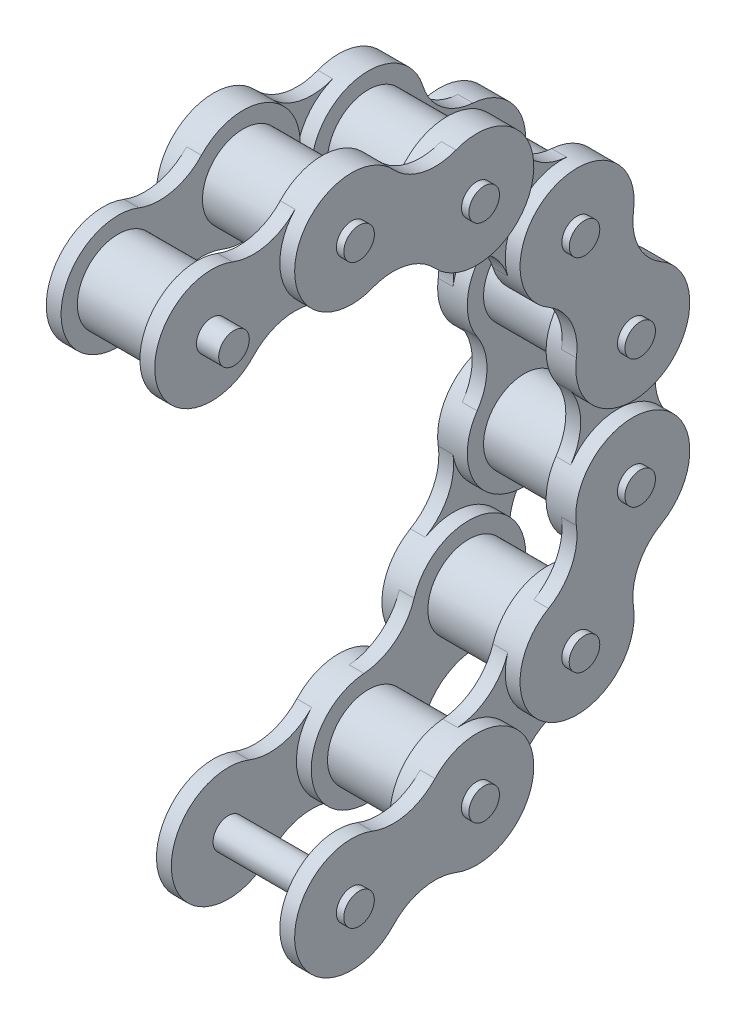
from build123d import *

# Parameters (mm, degrees)
BOSS_EXTRU_1_DEPTH      = 2.202
BOSS_EXTRU_1_2_DEPTH    = 2.202
BOSS_EXTRU_1_3_DEPTH    = 2.202
BOSS_EXTRU_1_4_DEPTH    = 2.202
ESQUISSE3_R             = 6.05
BOSS_EXTRU_2_DEPTH      = 11.7
BOSS_EXTRU_5_DEPTH      = 2.202
BOSS_EXTRU_6_DEPTH      = 3.303
BOSS_EXTRU_6_DEPTH_BACK = 19.407
ESQUISSE10_R            = 2.269
BOSS_EXTRU_7_DEPTH      = 2.202
BOSS_EXTRU_8_START      = 2.202
BOSS_EXTRU_8_DEPTH      = 2.202
BOSS_EXTRU_9_DEPTH      = 1.1
BOSS_EXTRU_9_DEPTH_BACK = 21.609
ESQUISSE13_R            = 2.269


with BuildPart() as part:
    # Esquisse2 → Boss.-Extru.1 (new body)
    with BuildSketch(Plane(origin=(5.55, 0, 0), x_dir=(0, 0, -1), z_dir=(1, 0, 0))):
        with BuildLine():
            ThreePointArc((26.661688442, 41.069207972), (11.953702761, 43.84472778), (17.931784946, 30.122815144))
            ThreePointArc((17.931784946, 30.122815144), (22.569484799, 28.299791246), (25.378581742, 24.183889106))
            ThreePointArc((25.378581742, 24.183889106), (40.086567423, 21.408369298), (34.108485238, 35.130281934))
            ThreePointArc((34.108485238, 35.130281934), (29.470785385, 36.953305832), (26.661688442, 41.069207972))
        make_face()
    extrude(amount=BOSS_EXTRU_1_DEPTH)



with BuildPart() as body_2:
    # Esquisse2 → Boss.-Extru.1 2 (new body)
    with BuildSketch(Plane(origin=(5.55, 0, 0), x_dir=(0, 0, -1), z_dir=(1, 0, 0))):
        with BuildLine():
            ThreePointArc((48.732609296, 4.760069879), (41.732648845, 17.989918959), (34.731368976, 4.760768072))
            ThreePointArc((34.731368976, 4.760768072), (36.197511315, -0.001805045), (34.730893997, -4.764231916))
            ThreePointArc((34.730893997, -4.764231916), (41.730854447, -17.994080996), (48.732134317, -4.764930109))
            ThreePointArc((48.732134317, -4.764930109), (47.265991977, -0.002356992), (48.732609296, 4.760069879))
        make_face()
    extrude(amount=BOSS_EXTRU_1_2_DEPTH)


with BuildPart() as body_3:
    # Esquisse2 → Boss.-Extru.1 3 (new body)
    with BuildSketch(Plane(origin=(5.55, 0, 0), x_dir=(0, 0, -1), z_dir=(1, 0, 0))):
        with BuildLine():
            ThreePointArc((34.104981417, -35.133683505), (40.084432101, -21.41236715), (25.376169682, -24.186420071))
            ThreePointArc((25.376169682, -24.186420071), (22.566662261, -28.30204203), (17.928780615, -30.124603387))
            ThreePointArc((17.928780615, -30.124603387), (11.949329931, -43.845919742), (26.65759235, -41.071866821))
            ThreePointArc((26.65759235, -41.071866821), (29.467099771, -36.956244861), (34.104981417, -35.133683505))
        make_face()
    extrude(amount=BOSS_EXTRU_1_3_DEPTH)


with BuildPart() as body_4:
    # Esquisse2 → Boss.-Extru.1 4 (new body)
    with BuildSketch(Plane(origin=(5.55, 0, 0), x_dir=(0, 0, -1), z_dir=(1, 0, 0))):
        with BuildLine():
            ThreePointArc((-3.085309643, 34.920105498), (8.254714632, 44.689046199), (-6.20087872, 48.570305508))
            ThreePointArc((-6.20087872, 48.570305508), (-10.517672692, 46.080934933), (-15.487067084, 46.450793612))
            ThreePointArc((-15.487067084, 46.450793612), (-26.82709136, 36.681852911), (-12.371498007, 32.800593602))
            ThreePointArc((-12.371498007, 32.800593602), (-8.054704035, 35.289964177), (-3.085309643, 34.920105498))
        make_face()
    extrude(amount=BOSS_EXTRU_1_4_DEPTH)


with BuildPart() as part_1:
    add(part.part)

    add(body_2.part)  # Boss.-Extru.2 merges body 2

    add(body_3.part)  # Boss.-Extru.2 merges body 3

    add(body_4.part)  # Boss.-Extru.2 merges body 4
    # Esquisse3 → Boss.-Extru.2 (add)
    with BuildSketch(Plane(origin=(7.752, 0, 0), x_dir=(0, 0, -1), z_dir=(1, 0, 0))):
        with Locations((-18.572376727, 38.565937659)):
            Circle(ESQUISSE3_R)
        with Locations((0, 42.804961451)):
            Circle(ESQUISSE3_R)
        with Locations((18.573338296, 38.565474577)):
            Circle(ESQUISSE3_R)
        with Locations((33.466931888, 26.687622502)):
            Circle(ESQUISSE3_R)
        with Locations((41.732226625, 9.52291897)):
            Circle(ESQUISSE3_R)
        with Locations((41.731276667, -9.527081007)):
            Circle(ESQUISSE3_R)
        with Locations((33.464270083, -26.69096013)):
            Circle(ESQUISSE3_R)
        with Locations((18.56949195, -38.567326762)):
            Circle(ESQUISSE3_R)
    extrude(amount=BOSS_EXTRU_2_DEPTH)

    # Esquisse9 → Boss.-Extru.5 (add)
    with BuildSketch(Plane(origin=(19.452, 0, 0), x_dir=(0, 0, -1), z_dir=(1, 0, 0))):
        with BuildLine():
            ThreePointArc((-15.487067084, 46.450793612), (-26.82709136, 36.681852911), (-12.371498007, 32.800593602))
            ThreePointArc((-12.371498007, 32.800593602), (-8.054704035, 35.289964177), (-3.085309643, 34.920105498))
            ThreePointArc((-3.085309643, 34.920105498), (8.254714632, 44.689046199), (-6.20087872, 48.570305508))
            ThreePointArc((-6.20087872, 48.570305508), (-10.517672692, 46.080934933), (-15.487067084, 46.450793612))
        make_face()
        with BuildLine():
            ThreePointArc((25.378581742, 24.183889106), (40.086567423, 21.408369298), (34.108485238, 35.130281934))
            ThreePointArc((34.108485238, 35.130281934), (29.470785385, 36.953305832), (26.661688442, 41.069207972))
            ThreePointArc((26.661688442, 41.069207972), (11.953702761, 43.84472778), (17.931784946, 30.122815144))
            ThreePointArc((17.931784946, 30.122815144), (22.569484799, 28.299791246), (25.378581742, 24.183889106))
        make_face()
        with BuildLine():
            ThreePointArc((34.730893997, -4.764231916), (41.730854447, -17.994080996), (48.732134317, -4.764930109))
            ThreePointArc((48.732134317, -4.764930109), (47.265991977, -0.002356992), (48.732609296, 4.760069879))
            ThreePointArc((48.732609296, 4.760069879), (41.732648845, 17.989918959), (34.731368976, 4.760768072))
            ThreePointArc((34.731368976, 4.760768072), (36.197511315, -0.001805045), (34.730893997, -4.764231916))
        make_face()
        with BuildLine():
            ThreePointArc((17.928780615, -30.124603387), (11.949329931, -43.845919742), (26.65759235, -41.071866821))
            ThreePointArc((26.65759235, -41.071866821), (29.467099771, -36.956244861), (34.104981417, -35.133683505))
            ThreePointArc((34.104981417, -35.133683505), (40.084432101, -21.41236715), (25.376169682, -24.186420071))
            ThreePointArc((25.376169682, -24.186420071), (22.566662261, -28.30204203), (17.928780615, -30.124603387))
        make_face()
    extrude(amount=BOSS_EXTRU_5_DEPTH)

    # Esquisse10 → Boss.-Extru.6 (add, two sides: drawn at the far end of the back side and taken through both)
    with BuildSketch(Plane(origin=(21.654, 0, 0), x_dir=(0, 0, -1), z_dir=(1, 0, 0)).offset(-BOSS_EXTRU_6_DEPTH_BACK)):
        with Locations((-18.572376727, 38.565937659)):
            Circle(ESQUISSE10_R)
        with Locations((0, 42.804961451)):
            Circle(ESQUISSE10_R)
        with Locations((18.573338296, 38.565474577)):
            Circle(ESQUISSE10_R)
        with Locations((33.466931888, 26.687622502)):
            Circle(ESQUISSE10_R)
        with Locations((41.732226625, 9.52291897)):
            Circle(ESQUISSE10_R)
        with Locations((41.731276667, -9.527081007)):
            Circle(ESQUISSE10_R)
        with Locations((33.464270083, -26.69096013)):
            Circle(ESQUISSE10_R)
        with Locations((18.56949195, -38.567326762)):
            Circle(ESQUISSE10_R)
    extrude(amount=BOSS_EXTRU_6_DEPTH + BOSS_EXTRU_6_DEPTH_BACK)

    # Esquisse11 → Boss.-Extru.7 (add)
    with BuildSketch(Plane(origin=(21.654, 0, 0), x_dir=(0, 0, -1), z_dir=(1, 0, 0))):
        with BuildLine():
            ThreePointArc((6.201164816, 48.569997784), (-8.254691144, 44.689149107), (3.085504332, 34.920181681))
            ThreePointArc((3.085504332, 34.920181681), (8.05519632, 35.290093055), (12.37217348, 32.800438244))
            ThreePointArc((12.37217348, 32.800438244), (26.82802944, 36.681286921), (15.487833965, 46.450254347))
            ThreePointArc((15.487833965, 46.450254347), (10.518141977, 46.080342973), (6.201164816, 48.569997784))
        make_face()
        with BuildLine():
            ThreePointArc((41.840550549, 25.433589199), (29.793523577, 34.316263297), (29.225960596, 19.359304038))
            ThreePointArc((29.225960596, 19.359304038), (32.613630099, 15.704393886), (33.358607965, 10.776952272))
            ThreePointArc((33.358607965, 10.776952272), (45.405634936, 1.894278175), (45.973197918, 16.851237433))
            ThreePointArc((45.973197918, 16.851237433), (42.585528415, 20.506147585), (41.840550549, 25.433589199))
        make_face()
        with BuildLine():
            ThreePointArc((45.971517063, -16.855822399), (45.405445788, -1.89880661), (33.35753298, -10.780279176))
            ThreePointArc((33.35753298, -10.780279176), (32.612063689, -15.707646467), (29.224029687, -19.362218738))
            ThreePointArc((29.224029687, -19.362218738), (29.790100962, -34.319234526), (41.83801377, -25.43776196))
            ThreePointArc((41.83801377, -25.43776196), (42.583483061, -20.51039467), (45.971517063, -16.855822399))
        make_face()
        with BuildLine():
            ThreePointArc((15.48320126, -46.451798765), (26.824370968, -36.683962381), (12.368902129, -32.801671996))
            ThreePointArc((12.368902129, -32.801671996), (8.051676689, -35.290896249), (3.082021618, -34.920489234))
            ThreePointArc((3.082021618, -34.920489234), (-8.25914809, -44.688325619), (6.196320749, -48.570616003))
            ThreePointArc((6.196320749, -48.570616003), (10.513546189, -46.081391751), (15.48320126, -46.451798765))
        make_face()
    extrude(amount=BOSS_EXTRU_7_DEPTH)

    # Esquisse12 → Boss.-Extru.8 (add)
    with BuildSketch(Plane.ZY.offset(-5.55).offset(BOSS_EXTRU_8_START)):
        with BuildLine():
            ThreePointArc((-3.085504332, 34.920181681), (8.254691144, 44.689149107), (-6.201164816, 48.569997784))
            ThreePointArc((-6.201164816, 48.569997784), (-10.518141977, 46.080342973), (-15.487833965, 46.450254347))
            ThreePointArc((-15.487833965, 46.450254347), (-26.82802944, 36.681286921), (-12.37217348, 32.800438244))
            ThreePointArc((-12.37217348, 32.800438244), (-8.05519632, 35.290093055), (-3.085504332, 34.920181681))
        make_face()
        with BuildLine():
            ThreePointArc((-45.973197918, 16.851237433), (-42.585528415, 20.506147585), (-41.840550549, 25.433589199))
            ThreePointArc((-41.840550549, 25.433589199), (-29.793523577, 34.316263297), (-29.225960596, 19.359304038))
            ThreePointArc((-29.225960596, 19.359304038), (-32.613630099, 15.704393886), (-33.358607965, 10.776952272))
            ThreePointArc((-33.358607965, 10.776952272), (-45.405634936, 1.894278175), (-45.973197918, 16.851237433))
        make_face()
        with BuildLine():
            ThreePointArc((-41.83801377, -25.43776196), (-42.583483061, -20.51039467), (-45.971517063, -16.855822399))
            ThreePointArc((-45.971517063, -16.855822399), (-45.405445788, -1.89880661), (-33.35753298, -10.780279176))
            ThreePointArc((-33.35753298, -10.780279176), (-32.612063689, -15.707646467), (-29.224029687, -19.362218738))
            ThreePointArc((-29.224029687, -19.362218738), (-29.790100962, -34.319234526), (-41.83801377, -25.43776196))
        make_face()
        with BuildLine():
            ThreePointArc((-6.196320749, -48.570616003), (-10.513546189, -46.081391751), (-15.48320126, -46.451798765))
            ThreePointArc((-15.48320126, -46.451798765), (-26.824370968, -36.683962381), (-12.368902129, -32.801671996))
            ThreePointArc((-12.368902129, -32.801671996), (-8.051676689, -35.290896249), (-3.082021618, -34.920489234))
            ThreePointArc((-3.082021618, -34.920489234), (8.25914809, -44.688325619), (-6.196320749, -48.570616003))
        make_face()
    extrude(amount=-BOSS_EXTRU_8_DEPTH)

    # Esquisse13 → Boss.-Extru.9 (add, two sides: drawn at the far end of the back side and taken through both)
    with BuildSketch(Plane(origin=(23.856, 0, 0), x_dir=(0, 0, -1), z_dir=(1, 0, 0)).offset(-BOSS_EXTRU_9_DEPTH_BACK)):
        with Locations((-0.004269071, -42.804961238)):
            Circle(ESQUISSE13_R)
    extrude(amount=BOSS_EXTRU_9_DEPTH + BOSS_EXTRU_9_DEPTH_BACK)


solid = part_1.part
